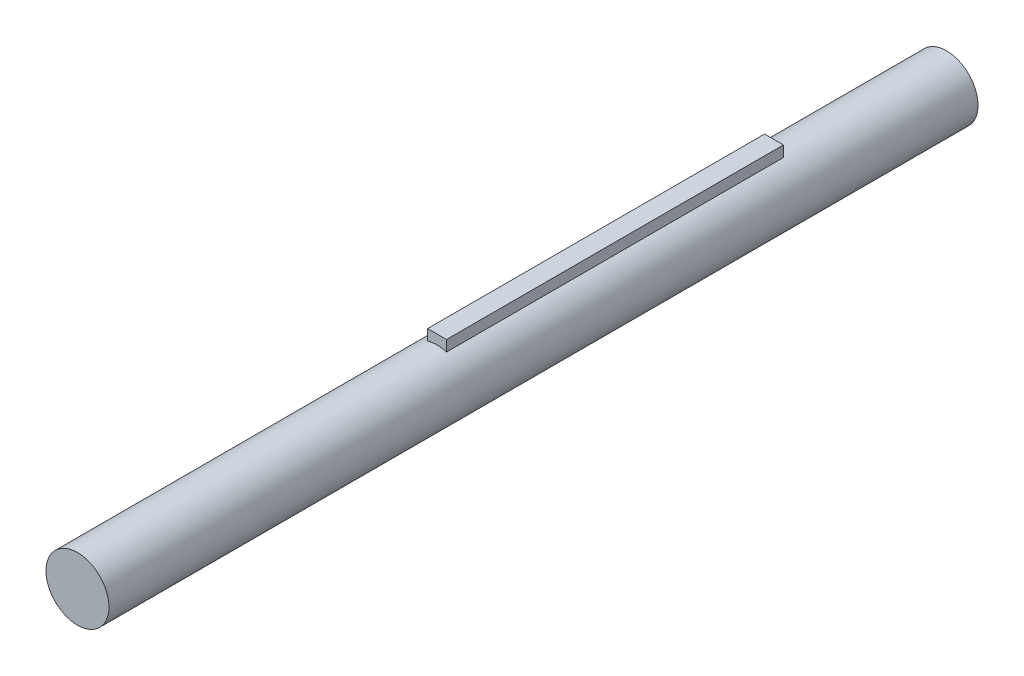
from build123d import *

# Parameters (mm, degrees)
BOSS_EXTRUDE1_DEPTH = 135.89
SKETCH3_R           = 12.7
BOSS_EXTRUDE2_DEPTH = 145.034
BOSS_EXTRUDE3_START = 69.596
SKETCH4_R           = 12.7
BOSS_EXTRUDE3_DEPTH = 69.596


with BuildPart() as part:
    # Sketch2 → Boss-Extrude1 (new body)
    with BuildSketch(Plane.XY):
        with BuildLine():
            Line((3.81, 16.51), (-3.81, 16.51))
            Line((-3.81, 16.51), (-3.81, 12.115027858))
            ThreePointArc((-3.81, 12.115027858), (0, -12.7), (3.81, 12.115027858))
            Line((3.81, 12.115027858), (3.81, 16.51))
        make_face()
    extrude(amount=BOSS_EXTRUDE1_DEPTH)

    # Sketch3 → Boss-Extrude2 (add)
    with BuildSketch(Plane.XY.offset(135.89)):
        with Locations(Location((0, 0, 0), (0, 0, 107.457603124))):
            Circle(SKETCH3_R)
    extrude(amount=BOSS_EXTRUDE2_DEPTH)

    # Sketch4 → Boss-Extrude3 (add)
    with BuildSketch(Plane(origin=(0, 0, 0), x_dir=(-1, 0, 0), z_dir=(0, 0, -1)).offset(BOSS_EXTRUDE3_START)):
        Circle(SKETCH4_R)
    extrude(amount=-BOSS_EXTRUDE3_DEPTH)


solid = part.part
